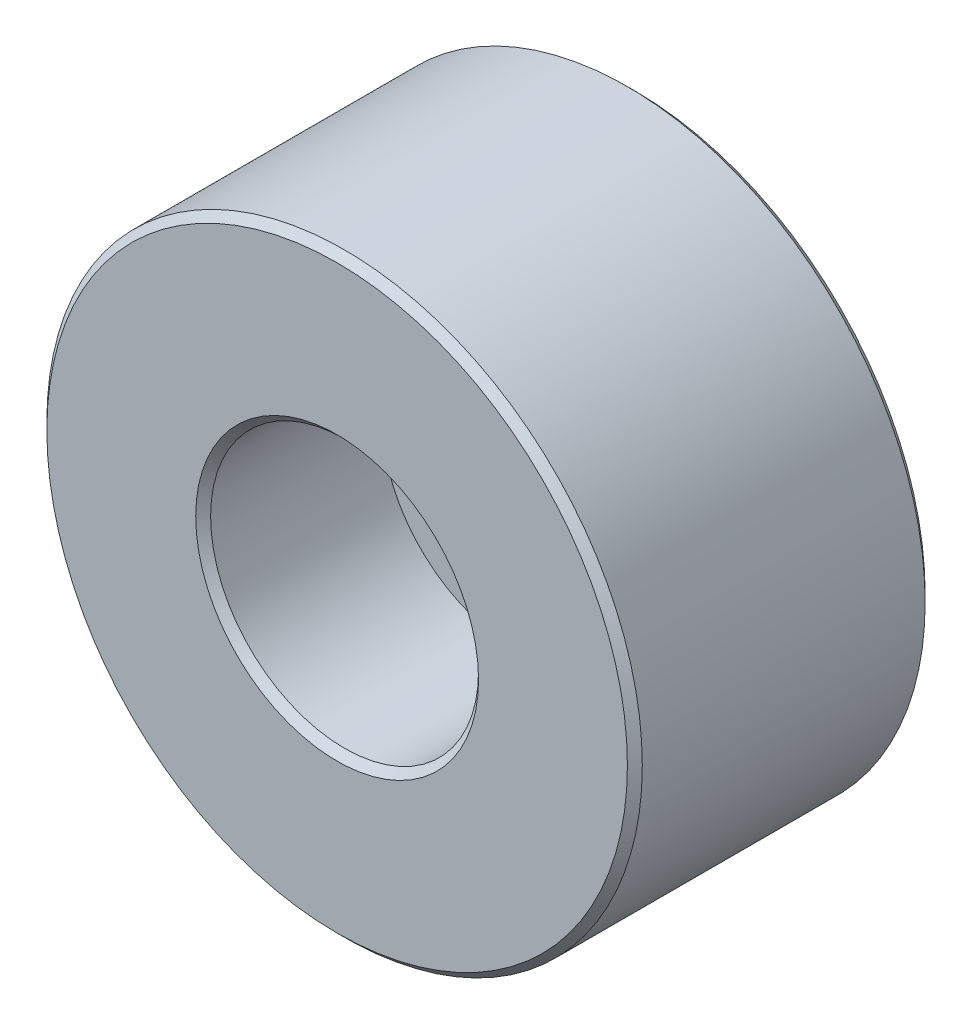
from build123d import *

# Parameters (mm, degrees)
CHANFREIN1_SIZE = 0.5


with BuildPart() as part:
    # Esquisse1 → Base-R_volution (revolve)
    with BuildSketch(Plane.XZ.offset(185.034678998), mode=Mode.PRIVATE) as base_r_volution_sk:
        Polygon((20, 20), (9, 20), (9, 8), (5.5, 8), (5.5, -6), (9, -6), (9, 0), (20, 0), align=None)
    revolve(base_r_volution_sk.sketch.rotate(Axis((0, -185.034678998, 20), (0, 0, -1)), 180), axis=Axis((0, -185.034678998, 20), (0, 0, -1)))

    # Chanfrein1
    chanfrein1_edges = [part.edges().sort_by_distance(p)[0] for p in [
        (20, -185.034678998, 0),
        (9, -185.034678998, -6),
        (9, -185.034678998, 20),
        (20, -185.034678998, 20),
    ]]
    chamfer(chanfrein1_edges, length=CHANFREIN1_SIZE)


solid = part.part
